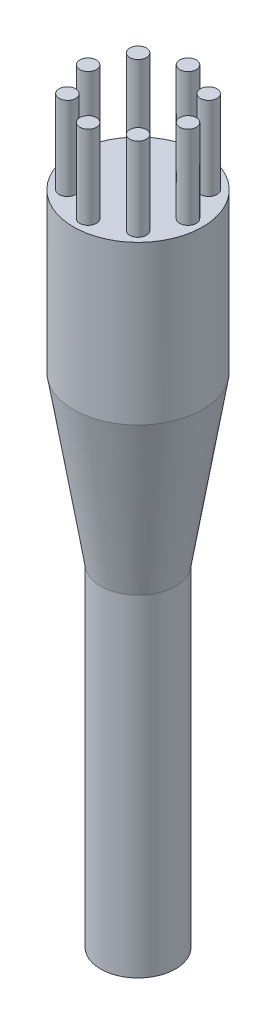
from build123d import *

# Parameters (mm, degrees)
SKETCH2_R         = 7.75
EXTRUDE1_DEPTH    = 19
SKETCH5_R         = 1
EXTRUDE4_DEPTH    = 10
CIRPATTERN1_COUNT = 8


with BuildPart() as part:
    # Sketch2 → Extrude1 (new body)
    with BuildSketch(Plane(origin=(0, 0, 0), x_dir=(1, 0, 0), z_dir=(0, 1, 0))):
        with Locations(Location((0, 0, 0), (0, 0, 270))):
            Circle(SKETCH2_R)
    extrude(amount=EXTRUDE1_DEPTH)

    # Sketch5 → Extrude4 (add)
    with BuildSketch(Plane(origin=(0, 19, 0), x_dir=(-1, 0, 0), z_dir=(0, 1, 0))):
        with Locations(Location((0, -6, 0), (0, 0, 90))):
            Circle(SKETCH5_R)
    extrude4 = extrude(amount=EXTRUDE4_DEPTH)

    # CirPattern1: Extrude4 ×8 about axis
    cirpattern1_axis = Axis((0, 0, 0), (0, 1, 0))
    for i in range(1, CIRPATTERN1_COUNT):
        add(extrude4.rotate(cirpattern1_axis, i * 360 / CIRPATTERN1_COUNT))

    # Sketch7 → Revolve1 (revolve)
    with BuildSketch(Plane(origin=(0, 0, 0), x_dir=(0, 0, -1), z_dir=(1, 0, 0))):
        Polygon((-7.75, 0), (-4.5, -20), (-4.5, -59.816846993), (0, -59.816846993), (0, 0), align=None)
    revolve(axis=Axis((0, 73.49787234, 0), (0, -1, 0)))


solid = part.part
